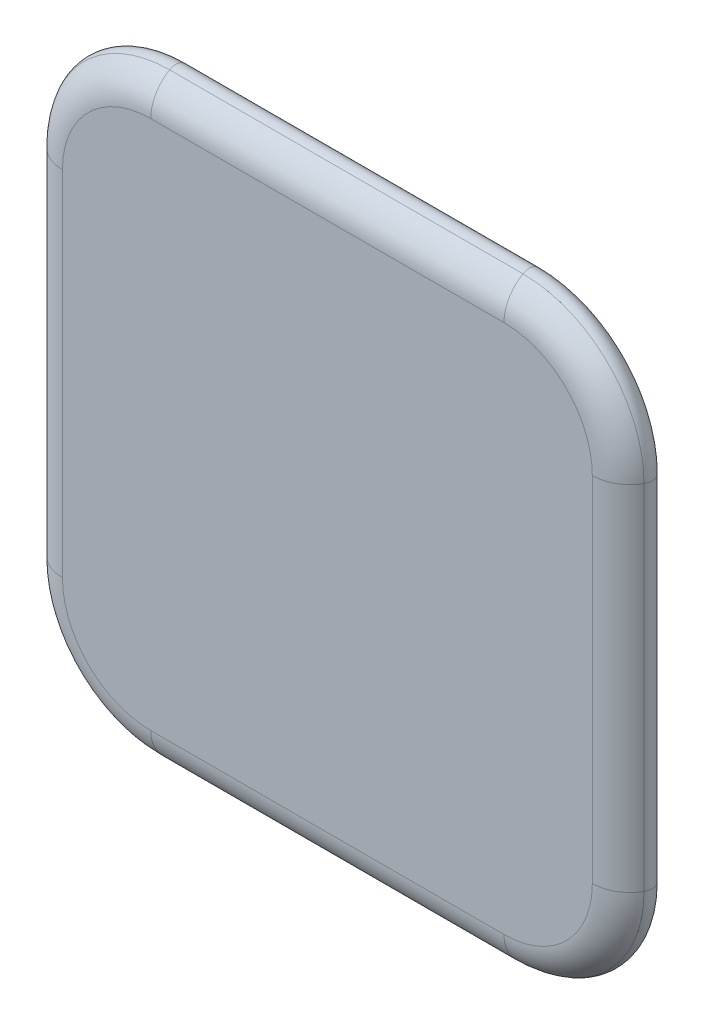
ISO-10303-21;
HEADER;
FILE_DESCRIPTION(('STEP AP214'),'2;1');
FILE_NAME('part.step','',(''),(''),'','','');
FILE_SCHEMA(('AUTOMOTIVE_DESIGN { 1 0 10303 214 1 1 1 1 }'));
ENDSEC;
DATA;
#1=APPLICATION_CONTEXT('core data for automotive mechanical design processes');
#2=APPLICATION_PROTOCOL_DEFINITION('international standard','automotive_design',2000,#1);
#3=PRODUCT_CONTEXT('',#1,'mechanical');
#4=PRODUCT('Part','Part','',(#3));
#5=PRODUCT_RELATED_PRODUCT_CATEGORY('part','',(#4));
#6=PRODUCT_DEFINITION_FORMATION('','',#4);
#7=PRODUCT_DEFINITION_CONTEXT('part definition',#1,'design');
#8=PRODUCT_DEFINITION('design','',#6,#7);
#9=PRODUCT_DEFINITION_SHAPE('','',#8);
#10=(LENGTH_UNIT() NAMED_UNIT(*) SI_UNIT(.MILLI.,.METRE.));
#11=(NAMED_UNIT(*) PLANE_ANGLE_UNIT() SI_UNIT($,.RADIAN.));
#12=(NAMED_UNIT(*) SI_UNIT($,.STERADIAN.) SOLID_ANGLE_UNIT());
#13=UNCERTAINTY_MEASURE_WITH_UNIT(LENGTH_MEASURE(1.E-05),#10,'distance_accuracy_value','');
#14=(GEOMETRIC_REPRESENTATION_CONTEXT(3) GLOBAL_UNCERTAINTY_ASSIGNED_CONTEXT((#13)) GLOBAL_UNIT_ASSIGNED_CONTEXT((#10,
#11,#12)) REPRESENTATION_CONTEXT('',''));
#15=CARTESIAN_POINT('',(0.,0.,0.));
#16=DIRECTION('',(0.,0.,1.));
#17=DIRECTION('',(1.,0.,0.));
#18=AXIS2_PLACEMENT_3D('',#15,#16,#17);
#19=CARTESIAN_POINT('',(1.,-7.73205080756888,47.));
#20=DIRECTION('',(0.,0.,-1.));
#21=DIRECTION('',(0.,1.,0.));
#22=AXIS2_PLACEMENT_3D('',#19,#20,#21);
#23=PLANE('',#22);
#24=DIRECTION('',(1.,0.,0.));
#25=VECTOR('',#24,1.);
#26=CARTESIAN_POINT('',(1.,-7.73205080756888,47.));
#27=LINE('',#26,#25);
#28=CARTESIAN_POINT('',(29.,-7.73205080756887,47.));
#29=VERTEX_POINT('',#28);
#30=CARTESIAN_POINT('',(1.,-7.73205080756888,47.));
#31=VERTEX_POINT('',#30);
#32=EDGE_CURVE('E192',#29,#31,#27,.F.);
#33=ORIENTED_EDGE('',*,*,#32,.T.);
#34=CARTESIAN_POINT('',(1.,1.,47.));
#35=DIRECTION('',(0.,0.,1.));
#36=DIRECTION('',(0.,-1.,0.));
#37=AXIS2_PLACEMENT_3D('',#34,#35,#36);
#38=CIRCLE('',#37,8.73205080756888);
#39=CARTESIAN_POINT('',(-7.73205080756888,1.,47.));
#40=VERTEX_POINT('',#39);
#41=EDGE_CURVE('E181',#31,#40,#38,.F.);
#42=ORIENTED_EDGE('',*,*,#41,.T.);
#43=DIRECTION('',(0.,-1.,0.));
#44=VECTOR('',#43,1.);
#45=CARTESIAN_POINT('',(-7.73205080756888,29.,47.));
#46=LINE('',#45,#44);
#47=CARTESIAN_POINT('',(-7.73205080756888,29.,47.));
#48=VERTEX_POINT('',#47);
#49=EDGE_CURVE('E184',#40,#48,#46,.F.);
#50=ORIENTED_EDGE('',*,*,#49,.T.);
#51=CARTESIAN_POINT('',(1.,29.,47.));
#52=DIRECTION('',(0.,0.,1.));
#53=DIRECTION('',(0.,-1.,0.));
#54=AXIS2_PLACEMENT_3D('',#51,#52,#53);
#55=CIRCLE('',#54,8.73205080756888);
#56=CARTESIAN_POINT('',(1.,37.7320508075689,47.));
#57=VERTEX_POINT('',#56);
#58=EDGE_CURVE('E186',#48,#57,#55,.F.);
#59=ORIENTED_EDGE('',*,*,#58,.T.);
#60=DIRECTION('',(1.,0.,0.));
#61=VECTOR('',#60,1.);
#62=CARTESIAN_POINT('',(29.,37.7320508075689,47.));
#63=LINE('',#62,#61);
#64=CARTESIAN_POINT('',(29.,37.7320508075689,47.));
#65=VERTEX_POINT('',#64);
#66=EDGE_CURVE('E188',#57,#65,#63,.T.);
#67=ORIENTED_EDGE('',*,*,#66,.T.);
#68=CARTESIAN_POINT('',(29.,29.,47.));
#69=DIRECTION('',(0.,0.,1.));
#70=DIRECTION('',(0.,-1.,0.));
#71=AXIS2_PLACEMENT_3D('',#68,#69,#70);
#72=CIRCLE('',#71,8.73205080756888);
#73=CARTESIAN_POINT('',(37.7320508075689,29.,47.));
#74=VERTEX_POINT('',#73);
#75=EDGE_CURVE('E190',#65,#74,#72,.F.);
#76=ORIENTED_EDGE('',*,*,#75,.T.);
#77=DIRECTION('',(0.,1.,0.));
#78=VECTOR('',#77,1.);
#79=CARTESIAN_POINT('',(37.7320508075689,1.,47.));
#80=LINE('',#79,#78);
#81=CARTESIAN_POINT('',(37.7320508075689,1.,47.));
#82=VERTEX_POINT('',#81);
#83=EDGE_CURVE('E195',#74,#82,#80,.F.);
#84=ORIENTED_EDGE('',*,*,#83,.T.);
#85=CARTESIAN_POINT('',(29.,1.,47.));
#86=DIRECTION('',(0.,0.,1.));
#87=DIRECTION('',(0.,-1.,0.));
#88=AXIS2_PLACEMENT_3D('',#85,#86,#87);
#89=CIRCLE('',#88,8.73205080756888);
#90=EDGE_CURVE('E153',#82,#29,#89,.F.);
#91=ORIENTED_EDGE('',*,*,#90,.T.);
#92=EDGE_LOOP('',(#33,#42,#50,#59,#67,#76,#84,#91));
#93=FACE_BOUND('',#92,.T.);
#94=ADVANCED_FACE('F34',(#93),#23,.T.);
#95=CARTESIAN_POINT('',(0.,0.,50.));
#96=DIRECTION('',(0.,0.,1.));
#97=DIRECTION('',(1.,0.,0.));
#98=AXIS2_PLACEMENT_3D('',#95,#96,#97);
#99=PLANE('',#98);
#100=DIRECTION('',(0.,-1.,0.));
#101=VECTOR('',#100,1.);
#102=CARTESIAN_POINT('',(36.,0.,50.));
#103=LINE('',#102,#101);
#104=CARTESIAN_POINT('',(36.,1.,50.));
#105=VERTEX_POINT('',#104);
#106=CARTESIAN_POINT('',(36.,29.,50.));
#107=VERTEX_POINT('',#106);
#108=EDGE_CURVE('E37',#105,#107,#103,.F.);
#109=ORIENTED_EDGE('',*,*,#108,.T.);
#110=CARTESIAN_POINT('',(29.,29.,50.));
#111=DIRECTION('',(0.,0.,1.));
#112=DIRECTION('',(1.,0.,0.));
#113=AXIS2_PLACEMENT_3D('',#110,#111,#112);
#114=CIRCLE('',#113,7.);
#115=CARTESIAN_POINT('',(29.,36.,50.));
#116=VERTEX_POINT('',#115);
#117=EDGE_CURVE('E197',#107,#116,#114,.T.);
#118=ORIENTED_EDGE('',*,*,#117,.T.);
#119=DIRECTION('',(1.,0.,0.));
#120=VECTOR('',#119,1.);
#121=CARTESIAN_POINT('',(1.,36.,50.));
#122=LINE('',#121,#120);
#123=CARTESIAN_POINT('',(1.,36.,50.));
#124=VERTEX_POINT('',#123);
#125=EDGE_CURVE('E211',#116,#124,#122,.F.);
#126=ORIENTED_EDGE('',*,*,#125,.T.);
#127=CARTESIAN_POINT('',(1.,29.,50.));
#128=DIRECTION('',(0.,0.,1.));
#129=DIRECTION('',(1.,0.,0.));
#130=AXIS2_PLACEMENT_3D('',#127,#128,#129);
#131=CIRCLE('',#130,7.);
#132=CARTESIAN_POINT('',(-6.,29.,50.));
#133=VERTEX_POINT('',#132);
#134=EDGE_CURVE('E214',#124,#133,#131,.T.);
#135=ORIENTED_EDGE('',*,*,#134,.T.);
#136=DIRECTION('',(0.,1.,0.));
#137=VECTOR('',#136,1.);
#138=CARTESIAN_POINT('',(-6.,0.,50.));
#139=LINE('',#138,#137);
#140=CARTESIAN_POINT('',(-6.,1.,50.));
#141=VERTEX_POINT('',#140);
#142=EDGE_CURVE('E217',#133,#141,#139,.F.);
#143=ORIENTED_EDGE('',*,*,#142,.T.);
#144=CARTESIAN_POINT('',(1.,1.,50.));
#145=DIRECTION('',(0.,0.,1.));
#146=DIRECTION('',(1.,0.,0.));
#147=AXIS2_PLACEMENT_3D('',#144,#145,#146);
#148=CIRCLE('',#147,7.);
#149=CARTESIAN_POINT('',(1.,-6.,50.));
#150=VERTEX_POINT('',#149);
#151=EDGE_CURVE('E220',#141,#150,#148,.T.);
#152=ORIENTED_EDGE('',*,*,#151,.T.);
#153=DIRECTION('',(1.,0.,0.));
#154=VECTOR('',#153,1.);
#155=CARTESIAN_POINT('',(29.,-6.,50.));
#156=LINE('',#155,#154);
#157=CARTESIAN_POINT('',(29.,-6.,50.));
#158=VERTEX_POINT('',#157);
#159=EDGE_CURVE('E222',#150,#158,#156,.T.);
#160=ORIENTED_EDGE('',*,*,#159,.T.);
#161=CARTESIAN_POINT('',(29.,1.,50.));
#162=DIRECTION('',(0.,0.,1.));
#163=DIRECTION('',(1.,0.,0.));
#164=AXIS2_PLACEMENT_3D('',#161,#162,#163);
#165=CIRCLE('',#164,7.);
#166=EDGE_CURVE('E50',#158,#105,#165,.T.);
#167=ORIENTED_EDGE('',*,*,#166,.T.);
#168=EDGE_LOOP('',(#109,#118,#126,#135,#143,#152,#160,#167));
#169=FACE_BOUND('',#168,.T.);
#170=ADVANCED_FACE('F224',(#169),#99,.T.);
#171=CARTESIAN_POINT('',(29.,29.,47.));
#172=DIRECTION('',(0.,0.,1.));
#173=DIRECTION('',(1.,0.,0.));
#174=AXIS2_PLACEMENT_3D('',#171,#172,#173);
#175=TOROIDAL_SURFACE('',#174,7.,3.);
#176=CARTESIAN_POINT('',(36.,29.,47.));
#177=DIRECTION('',(0.,1.,0.));
#178=DIRECTION('',(0.,0.,1.));
#179=AXIS2_PLACEMENT_3D('',#176,#177,#178);
#180=CIRCLE('',#179,3.);
#181=CARTESIAN_POINT('',(38.5980762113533,29.,48.5));
#182=VERTEX_POINT('',#181);
#183=EDGE_CURVE('E206',#107,#182,#180,.T.);
#184=ORIENTED_EDGE('',*,*,#183,.T.);
#185=CARTESIAN_POINT('',(29.,29.,48.5));
#186=DIRECTION('',(0.,0.,-1.));
#187=DIRECTION('',(0.,1.,0.));
#188=AXIS2_PLACEMENT_3D('',#185,#186,#187);
#189=CIRCLE('',#188,9.59807621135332);
#190=CARTESIAN_POINT('',(29.,38.5980762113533,48.5));
#191=VERTEX_POINT('',#190);
#192=EDGE_CURVE('E170',#182,#191,#189,.F.);
#193=ORIENTED_EDGE('',*,*,#192,.T.);
#194=CARTESIAN_POINT('',(29.,36.,47.));
#195=DIRECTION('',(1.,0.,0.));
#196=DIRECTION('',(0.,0.,-1.));
#197=AXIS2_PLACEMENT_3D('',#194,#195,#196);
#198=CIRCLE('',#197,3.);
#199=EDGE_CURVE('E208',#191,#116,#198,.T.);
#200=ORIENTED_EDGE('',*,*,#199,.T.);
#201=ORIENTED_EDGE('',*,*,#117,.F.);
#202=EDGE_LOOP('',(#184,#193,#200,#201));
#203=FACE_BOUND('',#202,.T.);
#204=ADVANCED_FACE('F258',(#203),#175,.T.);
#205=CARTESIAN_POINT('',(36.,0.,47.));
#206=DIRECTION('',(0.,-1.,0.));
#207=DIRECTION('',(0.,0.,-1.));
#208=AXIS2_PLACEMENT_3D('',#205,#206,#207);
#209=CYLINDRICAL_SURFACE('',#208,3.);
#210=CARTESIAN_POINT('',(36.,1.,47.));
#211=DIRECTION('',(0.,1.,0.));
#212=DIRECTION('',(0.,0.,1.));
#213=AXIS2_PLACEMENT_3D('',#210,#211,#212);
#214=CIRCLE('',#213,3.);
#215=CARTESIAN_POINT('',(38.5980762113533,1.,48.5));
#216=VERTEX_POINT('',#215);
#217=EDGE_CURVE('E125',#105,#216,#214,.T.);
#218=ORIENTED_EDGE('',*,*,#217,.T.);
#219=DIRECTION('',(0.,-1.,0.));
#220=VECTOR('',#219,1.);
#221=CARTESIAN_POINT('',(38.5980762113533,0.,48.5));
#222=LINE('',#221,#220);
#223=EDGE_CURVE('E133',#216,#182,#222,.F.);
#224=ORIENTED_EDGE('',*,*,#223,.T.);
#225=ORIENTED_EDGE('',*,*,#183,.F.);
#226=ORIENTED_EDGE('',*,*,#108,.F.);
#227=EDGE_LOOP('',(#218,#224,#225,#226));
#228=FACE_BOUND('',#227,.T.);
#229=ADVANCED_FACE('F137',(#228),#209,.T.);
#230=CARTESIAN_POINT('',(-9.,36.,47.));
#231=DIRECTION('',(-1.,0.,0.));
#232=DIRECTION('',(0.,0.,1.));
#233=AXIS2_PLACEMENT_3D('',#230,#231,#232);
#234=CYLINDRICAL_SURFACE('',#233,3.);
#235=ORIENTED_EDGE('',*,*,#199,.F.);
#236=DIRECTION('',(-1.,0.,0.));
#237=VECTOR('',#236,1.);
#238=CARTESIAN_POINT('',(-9.,38.5980762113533,48.5));
#239=LINE('',#238,#237);
#240=CARTESIAN_POINT('',(1.,38.5980762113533,48.5));
#241=VERTEX_POINT('',#240);
#242=EDGE_CURVE('E172',#191,#241,#239,.T.);
#243=ORIENTED_EDGE('',*,*,#242,.T.);
#244=CARTESIAN_POINT('',(1.,36.,47.));
#245=DIRECTION('',(1.,0.,0.));
#246=DIRECTION('',(0.,0.,-1.));
#247=AXIS2_PLACEMENT_3D('',#244,#245,#246);
#248=CIRCLE('',#247,3.);
#249=EDGE_CURVE('E139',#241,#124,#248,.T.);
#250=ORIENTED_EDGE('',*,*,#249,.T.);
#251=ORIENTED_EDGE('',*,*,#125,.F.);
#252=EDGE_LOOP('',(#235,#243,#250,#251));
#253=FACE_BOUND('',#252,.T.);
#254=ADVANCED_FACE('F262',(#253),#234,.T.);
#255=CARTESIAN_POINT('',(29.,29.,48.));
#256=DIRECTION('',(0.,0.,1.));
#257=DIRECTION('',(0.,-1.,0.));
#258=AXIS2_PLACEMENT_3D('',#255,#256,#257);
#259=TOROIDAL_SURFACE('',#258,8.73205080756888,1.);
#260=CARTESIAN_POINT('',(29.,37.7320508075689,48.));
#261=DIRECTION('',(-1.,0.,0.));
#262=DIRECTION('',(0.,0.,1.));
#263=AXIS2_PLACEMENT_3D('',#260,#261,#262);
#264=CIRCLE('',#263,1.);
#265=EDGE_CURVE('E155',#191,#65,#264,.T.);
#266=ORIENTED_EDGE('',*,*,#265,.F.);
#267=ORIENTED_EDGE('',*,*,#192,.F.);
#268=CARTESIAN_POINT('',(37.7320508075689,29.,48.));
#269=DIRECTION('',(0.,-1.,0.));
#270=DIRECTION('',(0.,0.,-1.));
#271=AXIS2_PLACEMENT_3D('',#268,#269,#270);
#272=CIRCLE('',#271,1.);
#273=EDGE_CURVE('E150',#74,#182,#272,.T.);
#274=ORIENTED_EDGE('',*,*,#273,.F.);
#275=ORIENTED_EDGE('',*,*,#75,.F.);
#276=EDGE_LOOP('',(#266,#267,#274,#275));
#277=FACE_BOUND('',#276,.T.);
#278=ADVANCED_FACE('F254',(#277),#259,.T.);
#279=CARTESIAN_POINT('',(29.,1.,47.));
#280=DIRECTION('',(0.,0.,1.));
#281=DIRECTION('',(1.,0.,0.));
#282=AXIS2_PLACEMENT_3D('',#279,#280,#281);
#283=TOROIDAL_SURFACE('',#282,7.,3.);
#284=CARTESIAN_POINT('',(29.,-6.,47.));
#285=DIRECTION('',(1.,0.,0.));
#286=DIRECTION('',(0.,0.,-1.));
#287=AXIS2_PLACEMENT_3D('',#284,#285,#286);
#288=CIRCLE('',#287,3.);
#289=CARTESIAN_POINT('',(29.,-8.59807621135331,48.5));
#290=VERTEX_POINT('',#289);
#291=EDGE_CURVE('E127',#158,#290,#288,.T.);
#292=ORIENTED_EDGE('',*,*,#291,.T.);
#293=CARTESIAN_POINT('',(29.,1.,48.5));
#294=DIRECTION('',(0.,0.,-1.));
#295=DIRECTION('',(0.,1.,0.));
#296=AXIS2_PLACEMENT_3D('',#293,#294,#295);
#297=CIRCLE('',#296,9.59807621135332);
#298=EDGE_CURVE('E122',#290,#216,#297,.F.);
#299=ORIENTED_EDGE('',*,*,#298,.T.);
#300=ORIENTED_EDGE('',*,*,#217,.F.);
#301=ORIENTED_EDGE('',*,*,#166,.F.);
#302=EDGE_LOOP('',(#292,#299,#300,#301));
#303=FACE_BOUND('',#302,.T.);
#304=ADVANCED_FACE('F124',(#303),#283,.T.);
#305=CARTESIAN_POINT('',(37.7320508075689,0.,48.));
#306=DIRECTION('',(0.,-1.,0.));
#307=DIRECTION('',(0.,0.,-1.));
#308=AXIS2_PLACEMENT_3D('',#305,#306,#307);
#309=CYLINDRICAL_SURFACE('',#308,1.);
#310=ORIENTED_EDGE('',*,*,#273,.T.);
#311=ORIENTED_EDGE('',*,*,#223,.F.);
#312=CARTESIAN_POINT('',(37.7320508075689,1.,48.));
#313=DIRECTION('',(0.,-1.,0.));
#314=DIRECTION('',(0.,0.,-1.));
#315=AXIS2_PLACEMENT_3D('',#312,#313,#314);
#316=CIRCLE('',#315,1.);
#317=EDGE_CURVE('E147',#82,#216,#316,.T.);
#318=ORIENTED_EDGE('',*,*,#317,.F.);
#319=ORIENTED_EDGE('',*,*,#83,.F.);
#320=EDGE_LOOP('',(#310,#311,#318,#319));
#321=FACE_BOUND('',#320,.T.);
#322=ADVANCED_FACE('F145',(#321),#309,.T.);
#323=CARTESIAN_POINT('',(1.,29.,47.));
#324=DIRECTION('',(0.,0.,1.));
#325=DIRECTION('',(1.,0.,0.));
#326=AXIS2_PLACEMENT_3D('',#323,#324,#325);
#327=TOROIDAL_SURFACE('',#326,7.,3.);
#328=ORIENTED_EDGE('',*,*,#249,.F.);
#329=CARTESIAN_POINT('',(1.,29.,48.5));
#330=DIRECTION('',(0.,0.,-1.));
#331=DIRECTION('',(0.,1.,0.));
#332=AXIS2_PLACEMENT_3D('',#329,#330,#331);
#333=CIRCLE('',#332,9.59807621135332);
#334=CARTESIAN_POINT('',(-8.59807621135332,29.,48.5));
#335=VERTEX_POINT('',#334);
#336=EDGE_CURVE('E174',#241,#335,#333,.F.);
#337=ORIENTED_EDGE('',*,*,#336,.T.);
#338=CARTESIAN_POINT('',(-6.,29.,47.));
#339=DIRECTION('',(0.,1.,0.));
#340=DIRECTION('',(0.,0.,1.));
#341=AXIS2_PLACEMENT_3D('',#338,#339,#340);
#342=CIRCLE('',#341,3.);
#343=EDGE_CURVE('E140',#335,#133,#342,.T.);
#344=ORIENTED_EDGE('',*,*,#343,.T.);
#345=ORIENTED_EDGE('',*,*,#134,.F.);
#346=EDGE_LOOP('',(#328,#337,#344,#345));
#347=FACE_BOUND('',#346,.T.);
#348=ADVANCED_FACE('F267',(#347),#327,.T.);
#349=CARTESIAN_POINT('',(-9.,37.7320508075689,48.));
#350=DIRECTION('',(-1.,0.,0.));
#351=DIRECTION('',(0.,0.,1.));
#352=AXIS2_PLACEMENT_3D('',#349,#350,#351);
#353=CYLINDRICAL_SURFACE('',#352,1.);
#354=ORIENTED_EDGE('',*,*,#265,.T.);
#355=ORIENTED_EDGE('',*,*,#66,.F.);
#356=CARTESIAN_POINT('',(1.,37.7320508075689,48.));
#357=DIRECTION('',(-1.,0.,0.));
#358=DIRECTION('',(0.,0.,1.));
#359=AXIS2_PLACEMENT_3D('',#356,#357,#358);
#360=CIRCLE('',#359,1.);
#361=EDGE_CURVE('E154',#241,#57,#360,.T.);
#362=ORIENTED_EDGE('',*,*,#361,.F.);
#363=ORIENTED_EDGE('',*,*,#242,.F.);
#364=EDGE_LOOP('',(#354,#355,#362,#363));
#365=FACE_BOUND('',#364,.T.);
#366=ADVANCED_FACE('F276',(#365),#353,.T.);
#367=CARTESIAN_POINT('',(0.,-6.,47.));
#368=DIRECTION('',(-1.,0.,0.));
#369=DIRECTION('',(0.,0.,1.));
#370=AXIS2_PLACEMENT_3D('',#367,#368,#369);
#371=CYLINDRICAL_SURFACE('',#370,3.);
#372=CARTESIAN_POINT('',(1.,-6.,47.));
#373=DIRECTION('',(1.,0.,0.));
#374=DIRECTION('',(0.,0.,-1.));
#375=AXIS2_PLACEMENT_3D('',#372,#373,#374);
#376=CIRCLE('',#375,3.);
#377=CARTESIAN_POINT('',(1.,-8.59807621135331,48.5));
#378=VERTEX_POINT('',#377);
#379=EDGE_CURVE('E198',#150,#378,#376,.T.);
#380=ORIENTED_EDGE('',*,*,#379,.T.);
#381=DIRECTION('',(-1.,0.,0.));
#382=VECTOR('',#381,1.);
#383=CARTESIAN_POINT('',(0.,-8.59807621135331,48.5));
#384=LINE('',#383,#382);
#385=EDGE_CURVE('E132',#378,#290,#384,.F.);
#386=ORIENTED_EDGE('',*,*,#385,.T.);
#387=ORIENTED_EDGE('',*,*,#291,.F.);
#388=ORIENTED_EDGE('',*,*,#159,.F.);
#389=EDGE_LOOP('',(#380,#386,#387,#388));
#390=FACE_BOUND('',#389,.T.);
#391=ADVANCED_FACE('F228',(#390),#371,.T.);
#392=CARTESIAN_POINT('',(29.,1.,48.));
#393=DIRECTION('',(0.,0.,1.));
#394=DIRECTION('',(0.,-1.,0.));
#395=AXIS2_PLACEMENT_3D('',#392,#393,#394);
#396=TOROIDAL_SURFACE('',#395,8.73205080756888,1.);
#397=ORIENTED_EDGE('',*,*,#317,.T.);
#398=ORIENTED_EDGE('',*,*,#298,.F.);
#399=CARTESIAN_POINT('',(29.,-7.73205080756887,48.));
#400=DIRECTION('',(-1.,0.,0.));
#401=DIRECTION('',(0.,0.,1.));
#402=AXIS2_PLACEMENT_3D('',#399,#400,#401);
#403=CIRCLE('',#402,1.);
#404=EDGE_CURVE('E158',#29,#290,#403,.T.);
#405=ORIENTED_EDGE('',*,*,#404,.F.);
#406=ORIENTED_EDGE('',*,*,#90,.F.);
#407=EDGE_LOOP('',(#397,#398,#405,#406));
#408=FACE_BOUND('',#407,.T.);
#409=ADVANCED_FACE('F152',(#408),#396,.T.);
#410=CARTESIAN_POINT('',(-6.,0.,47.));
#411=DIRECTION('',(0.,1.,0.));
#412=DIRECTION('',(0.,0.,1.));
#413=AXIS2_PLACEMENT_3D('',#410,#411,#412);
#414=CYLINDRICAL_SURFACE('',#413,3.);
#415=ORIENTED_EDGE('',*,*,#343,.F.);
#416=DIRECTION('',(0.,1.,0.));
#417=VECTOR('',#416,1.);
#418=CARTESIAN_POINT('',(-8.59807621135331,0.,48.5));
#419=LINE('',#418,#417);
#420=CARTESIAN_POINT('',(-8.59807621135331,1.,48.5));
#421=VERTEX_POINT('',#420);
#422=EDGE_CURVE('E176',#335,#421,#419,.F.);
#423=ORIENTED_EDGE('',*,*,#422,.T.);
#424=CARTESIAN_POINT('',(-6.,1.,47.));
#425=DIRECTION('',(0.,1.,0.));
#426=DIRECTION('',(0.,0.,1.));
#427=AXIS2_PLACEMENT_3D('',#424,#425,#426);
#428=CIRCLE('',#427,3.);
#429=EDGE_CURVE('E201',#421,#141,#428,.T.);
#430=ORIENTED_EDGE('',*,*,#429,.T.);
#431=ORIENTED_EDGE('',*,*,#142,.F.);
#432=EDGE_LOOP('',(#415,#423,#430,#431));
#433=FACE_BOUND('',#432,.T.);
#434=ADVANCED_FACE('F272',(#433),#414,.T.);
#435=CARTESIAN_POINT('',(1.,29.,48.));
#436=DIRECTION('',(0.,0.,1.));
#437=DIRECTION('',(0.,-1.,0.));
#438=AXIS2_PLACEMENT_3D('',#435,#436,#437);
#439=TOROIDAL_SURFACE('',#438,8.73205080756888,1.);
#440=ORIENTED_EDGE('',*,*,#361,.T.);
#441=ORIENTED_EDGE('',*,*,#58,.F.);
#442=CARTESIAN_POINT('',(-7.73205080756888,29.,48.));
#443=DIRECTION('',(0.,-1.,0.));
#444=DIRECTION('',(0.,0.,-1.));
#445=AXIS2_PLACEMENT_3D('',#442,#443,#444);
#446=CIRCLE('',#445,1.);
#447=EDGE_CURVE('E165',#335,#48,#446,.T.);
#448=ORIENTED_EDGE('',*,*,#447,.F.);
#449=ORIENTED_EDGE('',*,*,#336,.F.);
#450=EDGE_LOOP('',(#440,#441,#448,#449));
#451=FACE_BOUND('',#450,.T.);
#452=ADVANCED_FACE('F274',(#451),#439,.T.);
#453=CARTESIAN_POINT('',(-7.73205080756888,0.,48.));
#454=DIRECTION('',(0.,1.,0.));
#455=DIRECTION('',(0.,0.,1.));
#456=AXIS2_PLACEMENT_3D('',#453,#454,#455);
#457=CYLINDRICAL_SURFACE('',#456,1.);
#458=ORIENTED_EDGE('',*,*,#447,.T.);
#459=ORIENTED_EDGE('',*,*,#49,.F.);
#460=CARTESIAN_POINT('',(-7.73205080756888,1.,48.));
#461=DIRECTION('',(0.,-1.,0.));
#462=DIRECTION('',(0.,0.,-1.));
#463=AXIS2_PLACEMENT_3D('',#460,#461,#462);
#464=CIRCLE('',#463,1.);
#465=EDGE_CURVE('E11',#421,#40,#464,.T.);
#466=ORIENTED_EDGE('',*,*,#465,.F.);
#467=ORIENTED_EDGE('',*,*,#422,.F.);
#468=EDGE_LOOP('',(#458,#459,#466,#467));
#469=FACE_BOUND('',#468,.T.);
#470=ADVANCED_FACE('F245',(#469),#457,.T.);
#471=CARTESIAN_POINT('',(1.,1.,47.));
#472=DIRECTION('',(0.,0.,1.));
#473=DIRECTION('',(1.,0.,0.));
#474=AXIS2_PLACEMENT_3D('',#471,#472,#473);
#475=TOROIDAL_SURFACE('',#474,7.,3.);
#476=ORIENTED_EDGE('',*,*,#429,.F.);
#477=CARTESIAN_POINT('',(1.,1.,48.5));
#478=DIRECTION('',(0.,0.,-1.));
#479=DIRECTION('',(0.,1.,0.));
#480=AXIS2_PLACEMENT_3D('',#477,#478,#479);
#481=CIRCLE('',#480,9.59807621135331);
#482=EDGE_CURVE('E178',#421,#378,#481,.F.);
#483=ORIENTED_EDGE('',*,*,#482,.T.);
#484=ORIENTED_EDGE('',*,*,#379,.F.);
#485=ORIENTED_EDGE('',*,*,#151,.F.);
#486=EDGE_LOOP('',(#476,#483,#484,#485));
#487=FACE_BOUND('',#486,.T.);
#488=ADVANCED_FACE('F238',(#487),#475,.T.);
#489=CARTESIAN_POINT('',(0.,-7.73205080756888,48.));
#490=DIRECTION('',(-1.,0.,0.));
#491=DIRECTION('',(0.,0.,1.));
#492=AXIS2_PLACEMENT_3D('',#489,#490,#491);
#493=CYLINDRICAL_SURFACE('',#492,1.);
#494=ORIENTED_EDGE('',*,*,#404,.T.);
#495=ORIENTED_EDGE('',*,*,#385,.F.);
#496=CARTESIAN_POINT('',(1.,-7.73205080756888,48.));
#497=DIRECTION('',(-1.,0.,0.));
#498=DIRECTION('',(0.,0.,1.));
#499=AXIS2_PLACEMENT_3D('',#496,#497,#498);
#500=CIRCLE('',#499,1.);
#501=EDGE_CURVE('E42',#31,#378,#500,.T.);
#502=ORIENTED_EDGE('',*,*,#501,.F.);
#503=ORIENTED_EDGE('',*,*,#32,.F.);
#504=EDGE_LOOP('',(#494,#495,#502,#503));
#505=FACE_BOUND('',#504,.T.);
#506=ADVANCED_FACE('F232',(#505),#493,.T.);
#507=CARTESIAN_POINT('',(1.,1.,48.));
#508=DIRECTION('',(0.,0.,1.));
#509=DIRECTION('',(0.,-1.,0.));
#510=AXIS2_PLACEMENT_3D('',#507,#508,#509);
#511=TOROIDAL_SURFACE('',#510,8.73205080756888,1.);
#512=ORIENTED_EDGE('',*,*,#501,.T.);
#513=ORIENTED_EDGE('',*,*,#482,.F.);
#514=ORIENTED_EDGE('',*,*,#465,.T.);
#515=ORIENTED_EDGE('',*,*,#41,.F.);
#516=EDGE_LOOP('',(#512,#513,#514,#515));
#517=FACE_BOUND('',#516,.T.);
#518=ADVANCED_FACE('F241',(#517),#511,.T.);
#519=CLOSED_SHELL('',(#94,#170,#204,#229,#254,#278,#304,#322,#348,#366,#391,#409,#434,#452,#470,
#488,#506,#518));
#520=MANIFOLD_SOLID_BREP('B2',#519);
#521=ADVANCED_BREP_SHAPE_REPRESENTATION('',(#18,#520),#14);
#522=SHAPE_DEFINITION_REPRESENTATION(#9,#521);
ENDSEC;
END-ISO-10303-21;
